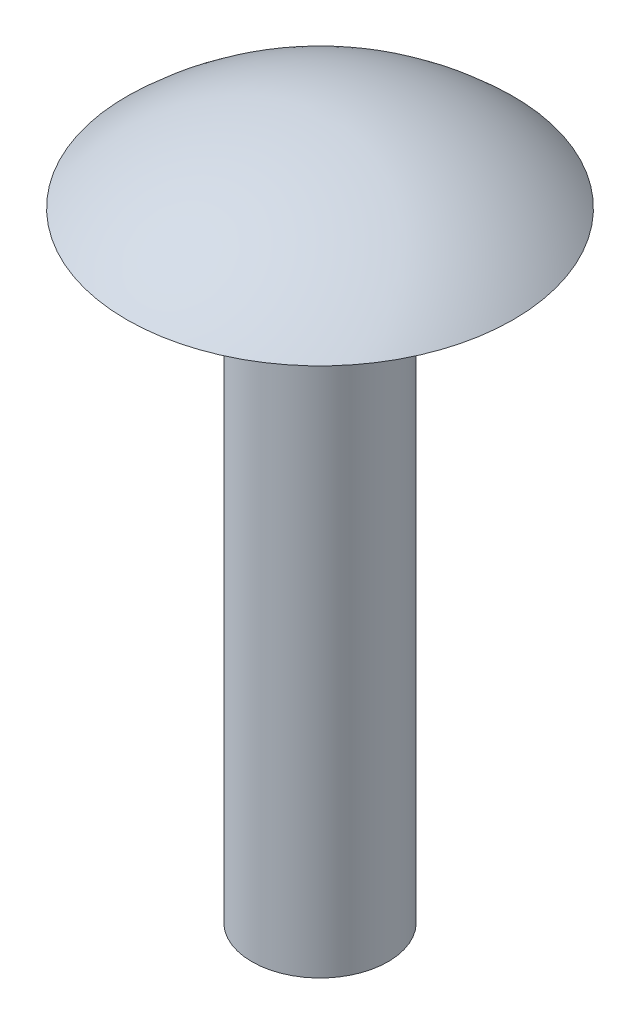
from build123d import *


with BuildPart() as part:
    # Sketch2 → Revolve1 (revolve)
    with BuildSketch(Plane.XY):
        with BuildLine():
            Line((1.397, 0), (3.96875, 0))
            ThreePointArc((3.96875, 0), (2.137237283, 1.175905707), (0, 1.5875))
            Line((0, 1.5875), (0, -12.7))
            Line((0, -12.7), (1.397, -12.7))
            Line((1.397, -12.7), (1.397, 0))
        make_face()
    revolve(axis=Axis((0, 3.532031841, 0), (0, -1, 0)))


solid = part.part
